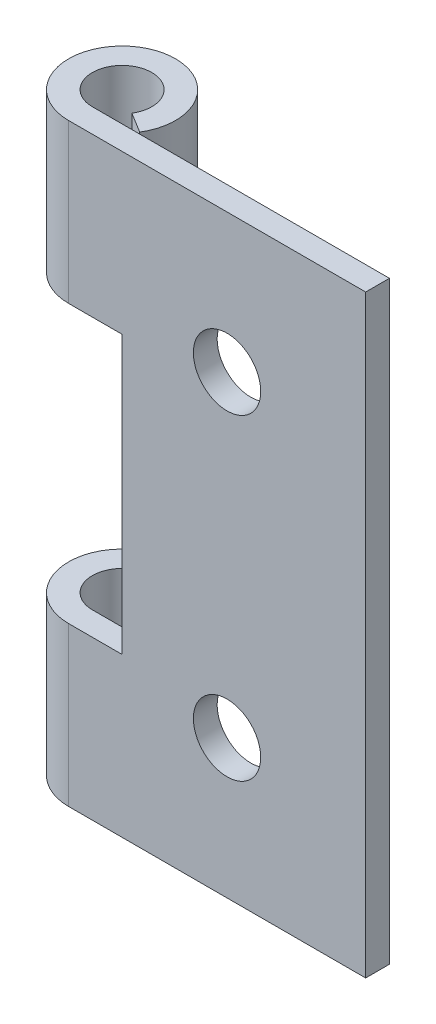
ISO-10303-21;
HEADER;
FILE_DESCRIPTION(('STEP AP214'),'2;1');
FILE_NAME('part.step','',(''),(''),'','','');
FILE_SCHEMA(('AUTOMOTIVE_DESIGN { 1 0 10303 214 1 1 1 1 }'));
ENDSEC;
DATA;
#1=APPLICATION_CONTEXT('core data for automotive mechanical design processes');
#2=APPLICATION_PROTOCOL_DEFINITION('international standard','automotive_design',2000,#1);
#3=PRODUCT_CONTEXT('',#1,'mechanical');
#4=PRODUCT('Part','Part','',(#3));
#5=PRODUCT_RELATED_PRODUCT_CATEGORY('part','',(#4));
#6=PRODUCT_DEFINITION_FORMATION('','',#4);
#7=PRODUCT_DEFINITION_CONTEXT('part definition',#1,'design');
#8=PRODUCT_DEFINITION('design','',#6,#7);
#9=PRODUCT_DEFINITION_SHAPE('','',#8);
#10=(LENGTH_UNIT() NAMED_UNIT(*) SI_UNIT(.MILLI.,.METRE.));
#11=(NAMED_UNIT(*) PLANE_ANGLE_UNIT() SI_UNIT($,.RADIAN.));
#12=(NAMED_UNIT(*) SI_UNIT($,.STERADIAN.) SOLID_ANGLE_UNIT());
#13=UNCERTAINTY_MEASURE_WITH_UNIT(LENGTH_MEASURE(1.E-05),#10,'distance_accuracy_value','');
#14=(GEOMETRIC_REPRESENTATION_CONTEXT(3) GLOBAL_UNCERTAINTY_ASSIGNED_CONTEXT((#13)) GLOBAL_UNIT_ASSIGNED_CONTEXT((#10,
#11,#12)) REPRESENTATION_CONTEXT('',''));
#15=CARTESIAN_POINT('',(0.,0.,0.));
#16=DIRECTION('',(0.,0.,1.));
#17=DIRECTION('',(1.,0.,0.));
#18=AXIS2_PLACEMENT_3D('',#15,#16,#17);
#19=CARTESIAN_POINT('',(0.,-30.,0.599999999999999));
#20=DIRECTION('',(0.,0.,1.));
#21=DIRECTION('',(1.,0.,0.));
#22=AXIS2_PLACEMENT_3D('',#19,#20,#21);
#23=PLANE('',#22);
#24=CARTESIAN_POINT('',(8.,-23.,0.599999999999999));
#25=DIRECTION('',(0.,0.,-1.));
#26=DIRECTION('',(-1.,0.,0.));
#27=AXIS2_PLACEMENT_3D('',#24,#25,#26);
#28=CIRCLE('',#27,1.7);
#29=CARTESIAN_POINT('',(6.3,-23.,0.599999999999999));
#30=VERTEX_POINT('',#29);
#31=EDGE_CURVE('E207',#30,#30,#28,.T.);
#32=ORIENTED_EDGE('',*,*,#31,.T.);
#33=EDGE_LOOP('',(#32));
#34=FACE_BOUND('',#33,.T.);
#35=CARTESIAN_POINT('',(8.,-7.,0.599999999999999));
#36=DIRECTION('',(0.,0.,-1.));
#37=DIRECTION('',(-1.,0.,0.));
#38=AXIS2_PLACEMENT_3D('',#35,#36,#37);
#39=CIRCLE('',#38,1.7);
#40=CARTESIAN_POINT('',(6.3,-7.,0.599999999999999));
#41=VERTEX_POINT('',#40);
#42=EDGE_CURVE('E249',#41,#41,#39,.T.);
#43=ORIENTED_EDGE('',*,*,#42,.T.);
#44=EDGE_LOOP('',(#43));
#45=FACE_BOUND('',#44,.T.);
#46=DIRECTION('',(0.,1.,0.));
#47=VECTOR('',#46,1.);
#48=CARTESIAN_POINT('',(0.,-30.,0.599999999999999));
#49=LINE('',#48,#47);
#50=CARTESIAN_POINT('',(0.,-8.,0.599999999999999));
#51=VERTEX_POINT('',#50);
#52=CARTESIAN_POINT('',(0.,0.,0.599999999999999));
#53=VERTEX_POINT('',#52);
#54=EDGE_CURVE('E121',#51,#53,#49,.T.);
#55=ORIENTED_EDGE('',*,*,#54,.F.);
#56=DIRECTION('',(-1.,0.,0.));
#57=VECTOR('',#56,1.);
#58=CARTESIAN_POINT('',(0.,-8.,0.599999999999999));
#59=LINE('',#58,#57);
#60=CARTESIAN_POINT('',(2.7,-8.,0.599999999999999));
#61=VERTEX_POINT('',#60);
#62=EDGE_CURVE('E183',#61,#51,#59,.T.);
#63=ORIENTED_EDGE('',*,*,#62,.F.);
#64=DIRECTION('',(0.,-1.,0.));
#65=VECTOR('',#64,1.);
#66=CARTESIAN_POINT('',(2.7,-8.,0.599999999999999));
#67=LINE('',#66,#65);
#68=CARTESIAN_POINT('',(2.7,-22.,0.599999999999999));
#69=VERTEX_POINT('',#68);
#70=EDGE_CURVE('E146',#61,#69,#67,.T.);
#71=ORIENTED_EDGE('',*,*,#70,.T.);
#72=DIRECTION('',(-1.,0.,0.));
#73=VECTOR('',#72,1.);
#74=CARTESIAN_POINT('',(0.,-22.,0.599999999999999));
#75=LINE('',#74,#73);
#76=CARTESIAN_POINT('',(0.,-22.,0.599999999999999));
#77=VERTEX_POINT('',#76);
#78=EDGE_CURVE('E210',#69,#77,#75,.T.);
#79=ORIENTED_EDGE('',*,*,#78,.T.);
#80=CARTESIAN_POINT('',(0.,-30.,0.599999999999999));
#81=VERTEX_POINT('',#80);
#82=EDGE_CURVE('E47',#81,#77,#49,.T.);
#83=ORIENTED_EDGE('',*,*,#82,.F.);
#84=DIRECTION('',(1.,0.,0.));
#85=VECTOR('',#84,1.);
#86=CARTESIAN_POINT('',(0.,-30.,0.599999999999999));
#87=LINE('',#86,#85);
#88=CARTESIAN_POINT('',(15.,-30.,0.599999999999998));
#89=VERTEX_POINT('',#88);
#90=EDGE_CURVE('E130',#81,#89,#87,.T.);
#91=ORIENTED_EDGE('',*,*,#90,.T.);
#92=DIRECTION('',(0.,1.,0.));
#93=VECTOR('',#92,1.);
#94=CARTESIAN_POINT('',(15.,-30.,0.599999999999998));
#95=LINE('',#94,#93);
#96=CARTESIAN_POINT('',(15.,0.,0.599999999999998));
#97=VERTEX_POINT('',#96);
#98=EDGE_CURVE('E11',#89,#97,#95,.T.);
#99=ORIENTED_EDGE('',*,*,#98,.T.);
#100=DIRECTION('',(1.,0.,0.));
#101=VECTOR('',#100,1.);
#102=CARTESIAN_POINT('',(0.,0.,0.599999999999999));
#103=LINE('',#102,#101);
#104=EDGE_CURVE('E158',#53,#97,#103,.T.);
#105=ORIENTED_EDGE('',*,*,#104,.F.);
#106=EDGE_LOOP('',(#55,#63,#71,#79,#83,#91,#99,#105));
#107=FACE_BOUND('',#106,.T.);
#108=ADVANCED_FACE('F38',(#34,#45,#107),#23,.T.);
#109=CARTESIAN_POINT('',(0.,-30.,-2.1));
#110=DIRECTION('',(0.,1.,0.));
#111=DIRECTION('',(0.,0.,1.));
#112=AXIS2_PLACEMENT_3D('',#109,#110,#111);
#113=CYLINDRICAL_SURFACE('',#112,2.7);
#114=DIRECTION('',(0.,1.,0.));
#115=VECTOR('',#114,1.);
#116=CARTESIAN_POINT('',(2.30184189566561,-30.,-0.688786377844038));
#117=LINE('',#116,#115);
#118=CARTESIAN_POINT('',(2.30184189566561,-8.,-0.688786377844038));
#119=VERTEX_POINT('',#118);
#120=CARTESIAN_POINT('',(2.30184189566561,0.,-0.688786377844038));
#121=VERTEX_POINT('',#120);
#122=EDGE_CURVE('E122',#119,#121,#117,.T.);
#123=ORIENTED_EDGE('',*,*,#122,.F.);
#124=CARTESIAN_POINT('',(0.,-8.,-2.1));
#125=DIRECTION('',(0.,-1.,0.));
#126=DIRECTION('',(0.,0.,-1.));
#127=AXIS2_PLACEMENT_3D('',#124,#125,#126);
#128=CIRCLE('',#127,2.7);
#129=EDGE_CURVE('E191',#51,#119,#128,.T.);
#130=ORIENTED_EDGE('',*,*,#129,.F.);
#131=ORIENTED_EDGE('',*,*,#54,.T.);
#132=CARTESIAN_POINT('',(0.,0.,-2.1));
#133=DIRECTION('',(0.,1.,0.));
#134=DIRECTION('',(0.,0.,1.));
#135=AXIS2_PLACEMENT_3D('',#132,#133,#134);
#136=CIRCLE('',#135,2.7);
#137=EDGE_CURVE('E155',#121,#53,#136,.T.);
#138=ORIENTED_EDGE('',*,*,#137,.F.);
#139=EDGE_LOOP('',(#123,#130,#131,#138));
#140=FACE_BOUND('',#139,.T.);
#141=ADVANCED_FACE('F189',(#140),#113,.T.);
#142=CARTESIAN_POINT('',(2.30184189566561,-30.,-0.688786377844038));
#143=DIRECTION('',(-0.522671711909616,0.,0.852534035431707));
#144=DIRECTION('',(0.852534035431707,0.,0.522671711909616));
#145=AXIS2_PLACEMENT_3D('',#142,#143,#144);
#146=PLANE('',#145);
#147=DIRECTION('',(0.,1.,0.));
#148=VECTOR('',#147,1.);
#149=CARTESIAN_POINT('',(1.27880105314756,-30.,-1.31599243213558));
#150=LINE('',#149,#148);
#151=CARTESIAN_POINT('',(1.27880105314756,-8.,-1.31599243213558));
#152=VERTEX_POINT('',#151);
#153=CARTESIAN_POINT('',(1.27880105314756,0.,-1.31599243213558));
#154=VERTEX_POINT('',#153);
#155=EDGE_CURVE('E163',#152,#154,#150,.T.);
#156=ORIENTED_EDGE('',*,*,#155,.F.);
#157=DIRECTION('',(-0.852534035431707,0.,-0.522671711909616));
#158=VECTOR('',#157,1.);
#159=CARTESIAN_POINT('',(1.27880105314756,-8.,-1.31599243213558));
#160=LINE('',#159,#158);
#161=EDGE_CURVE('E195',#119,#152,#160,.T.);
#162=ORIENTED_EDGE('',*,*,#161,.F.);
#163=ORIENTED_EDGE('',*,*,#122,.T.);
#164=DIRECTION('',(0.852534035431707,0.,0.522671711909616));
#165=VECTOR('',#164,1.);
#166=CARTESIAN_POINT('',(2.30184189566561,0.,-0.688786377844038));
#167=LINE('',#166,#165);
#168=EDGE_CURVE('E152',#154,#121,#167,.T.);
#169=ORIENTED_EDGE('',*,*,#168,.F.);
#170=EDGE_LOOP('',(#156,#162,#163,#169));
#171=FACE_BOUND('',#170,.T.);
#172=ADVANCED_FACE('F289',(#171),#146,.T.);
#173=CARTESIAN_POINT('',(0.,-30.,-2.1));
#174=DIRECTION('',(0.,1.,0.));
#175=DIRECTION('',(0.,0.,1.));
#176=AXIS2_PLACEMENT_3D('',#173,#174,#175);
#177=CYLINDRICAL_SURFACE('',#176,1.5);
#178=DIRECTION('',(0.,1.,0.));
#179=VECTOR('',#178,1.);
#180=CARTESIAN_POINT('',(0.,-30.,-0.600000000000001));
#181=LINE('',#180,#179);
#182=CARTESIAN_POINT('',(0.,-8.,-0.600000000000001));
#183=VERTEX_POINT('',#182);
#184=CARTESIAN_POINT('',(0.,0.,-0.600000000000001));
#185=VERTEX_POINT('',#184);
#186=EDGE_CURVE('E166',#183,#185,#181,.T.);
#187=ORIENTED_EDGE('',*,*,#186,.F.);
#188=CARTESIAN_POINT('',(0.,-8.,-2.1));
#189=DIRECTION('',(0.,1.,0.));
#190=DIRECTION('',(0.,0.,-1.));
#191=AXIS2_PLACEMENT_3D('',#188,#189,#190);
#192=CIRCLE('',#191,1.5);
#193=EDGE_CURVE('E216',#152,#183,#192,.T.);
#194=ORIENTED_EDGE('',*,*,#193,.F.);
#195=ORIENTED_EDGE('',*,*,#155,.T.);
#196=CARTESIAN_POINT('',(0.,0.,-2.1));
#197=DIRECTION('',(0.,-1.,0.));
#198=DIRECTION('',(0.,0.,1.));
#199=AXIS2_PLACEMENT_3D('',#196,#197,#198);
#200=CIRCLE('',#199,1.5);
#201=EDGE_CURVE('E149',#185,#154,#200,.T.);
#202=ORIENTED_EDGE('',*,*,#201,.F.);
#203=EDGE_LOOP('',(#187,#194,#195,#202));
#204=FACE_BOUND('',#203,.T.);
#205=ADVANCED_FACE('F272',(#204),#177,.F.);
#206=CARTESIAN_POINT('',(0.,-30.,-0.600000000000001));
#207=DIRECTION('',(0.,0.,-1.));
#208=DIRECTION('',(-1.,0.,0.));
#209=AXIS2_PLACEMENT_3D('',#206,#207,#208);
#210=PLANE('',#209);
#211=CARTESIAN_POINT('',(8.,-23.,-0.600000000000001));
#212=DIRECTION('',(0.,0.,-1.));
#213=DIRECTION('',(-1.,0.,0.));
#214=AXIS2_PLACEMENT_3D('',#211,#212,#213);
#215=CIRCLE('',#214,1.7);
#216=CARTESIAN_POINT('',(6.3,-23.,-0.600000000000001));
#217=VERTEX_POINT('',#216);
#218=EDGE_CURVE('E255',#217,#217,#215,.T.);
#219=ORIENTED_EDGE('',*,*,#218,.F.);
#220=EDGE_LOOP('',(#219));
#221=FACE_BOUND('',#220,.T.);
#222=CARTESIAN_POINT('',(8.,-7.,-0.600000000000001));
#223=DIRECTION('',(0.,0.,-1.));
#224=DIRECTION('',(-1.,0.,0.));
#225=AXIS2_PLACEMENT_3D('',#222,#223,#224);
#226=CIRCLE('',#225,1.7);
#227=CARTESIAN_POINT('',(6.3,-7.,-0.600000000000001));
#228=VERTEX_POINT('',#227);
#229=EDGE_CURVE('E252',#228,#228,#226,.T.);
#230=ORIENTED_EDGE('',*,*,#229,.F.);
#231=EDGE_LOOP('',(#230));
#232=FACE_BOUND('',#231,.T.);
#233=DIRECTION('',(0.,-1.,0.));
#234=VECTOR('',#233,1.);
#235=CARTESIAN_POINT('',(2.7,-8.,-0.600000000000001));
#236=LINE('',#235,#234);
#237=CARTESIAN_POINT('',(2.7,-8.,-0.600000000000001));
#238=VERTEX_POINT('',#237);
#239=CARTESIAN_POINT('',(2.7,-22.,-0.600000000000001));
#240=VERTEX_POINT('',#239);
#241=EDGE_CURVE('E197',#238,#240,#236,.T.);
#242=ORIENTED_EDGE('',*,*,#241,.F.);
#243=DIRECTION('',(1.,0.,0.));
#244=VECTOR('',#243,1.);
#245=CARTESIAN_POINT('',(0.,-8.,-0.600000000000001));
#246=LINE('',#245,#244);
#247=EDGE_CURVE('E243',#183,#238,#246,.T.);
#248=ORIENTED_EDGE('',*,*,#247,.F.);
#249=ORIENTED_EDGE('',*,*,#186,.T.);
#250=DIRECTION('',(-1.,0.,0.));
#251=VECTOR('',#250,1.);
#252=CARTESIAN_POINT('',(0.,0.,-0.600000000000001));
#253=LINE('',#252,#251);
#254=CARTESIAN_POINT('',(15.,0.,-0.600000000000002));
#255=VERTEX_POINT('',#254);
#256=EDGE_CURVE('E145',#255,#185,#253,.T.);
#257=ORIENTED_EDGE('',*,*,#256,.F.);
#258=DIRECTION('',(0.,1.,0.));
#259=VECTOR('',#258,1.);
#260=CARTESIAN_POINT('',(15.,-30.,-0.600000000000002));
#261=LINE('',#260,#259);
#262=CARTESIAN_POINT('',(15.,-30.,-0.600000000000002));
#263=VERTEX_POINT('',#262);
#264=EDGE_CURVE('E42',#263,#255,#261,.T.);
#265=ORIENTED_EDGE('',*,*,#264,.F.);
#266=DIRECTION('',(-1.,0.,0.));
#267=VECTOR('',#266,1.);
#268=CARTESIAN_POINT('',(0.,-30.,-0.600000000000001));
#269=LINE('',#268,#267);
#270=CARTESIAN_POINT('',(0.,-30.,-0.600000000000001));
#271=VERTEX_POINT('',#270);
#272=EDGE_CURVE('E137',#263,#271,#269,.T.);
#273=ORIENTED_EDGE('',*,*,#272,.T.);
#274=CARTESIAN_POINT('',(0.,-22.,-0.600000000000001));
#275=VERTEX_POINT('',#274);
#276=EDGE_CURVE('E164',#271,#275,#181,.T.);
#277=ORIENTED_EDGE('',*,*,#276,.T.);
#278=DIRECTION('',(1.,0.,0.));
#279=VECTOR('',#278,1.);
#280=CARTESIAN_POINT('',(0.,-22.,-0.600000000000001));
#281=LINE('',#280,#279);
#282=EDGE_CURVE('E206',#275,#240,#281,.T.);
#283=ORIENTED_EDGE('',*,*,#282,.T.);
#284=EDGE_LOOP('',(#242,#248,#249,#257,#265,#273,#277,#283));
#285=FACE_BOUND('',#284,.T.);
#286=ADVANCED_FACE('F173',(#221,#232,#285),#210,.T.);
#287=CARTESIAN_POINT('',(15.,-30.,-0.600000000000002));
#288=DIRECTION('',(1.,0.,0.));
#289=DIRECTION('',(0.,0.,-1.));
#290=AXIS2_PLACEMENT_3D('',#287,#288,#289);
#291=PLANE('',#290);
#292=DIRECTION('',(0.,0.,-1.));
#293=VECTOR('',#292,1.);
#294=CARTESIAN_POINT('',(15.,0.,-0.600000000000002));
#295=LINE('',#294,#293);
#296=EDGE_CURVE('E142',#97,#255,#295,.T.);
#297=ORIENTED_EDGE('',*,*,#296,.F.);
#298=ORIENTED_EDGE('',*,*,#98,.F.);
#299=DIRECTION('',(0.,0.,-1.));
#300=VECTOR('',#299,1.);
#301=CARTESIAN_POINT('',(15.,-30.,-0.600000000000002));
#302=LINE('',#301,#300);
#303=EDGE_CURVE('E160',#89,#263,#302,.T.);
#304=ORIENTED_EDGE('',*,*,#303,.T.);
#305=ORIENTED_EDGE('',*,*,#264,.T.);
#306=EDGE_LOOP('',(#297,#298,#304,#305));
#307=FACE_BOUND('',#306,.T.);
#308=ADVANCED_FACE('F40',(#307),#291,.T.);
#309=CARTESIAN_POINT('',(0.,-22.,-2.1));
#310=DIRECTION('',(0.,-1.,0.));
#311=DIRECTION('',(0.,0.,-1.));
#312=AXIS2_PLACEMENT_3D('',#309,#310,#311);
#313=CIRCLE('',#312,2.7);
#314=CARTESIAN_POINT('',(2.30184189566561,-22.,-0.688786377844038));
#315=VERTEX_POINT('',#314);
#316=EDGE_CURVE('E117',#77,#315,#313,.T.);
#317=ORIENTED_EDGE('',*,*,#316,.T.);
#318=CARTESIAN_POINT('',(2.30184189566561,-30.,-0.688786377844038));
#319=VERTEX_POINT('',#318);
#320=EDGE_CURVE('E109',#319,#315,#117,.T.);
#321=ORIENTED_EDGE('',*,*,#320,.F.);
#322=CARTESIAN_POINT('',(0.,-30.,-2.1));
#323=DIRECTION('',(0.,1.,0.));
#324=DIRECTION('',(0.,0.,1.));
#325=AXIS2_PLACEMENT_3D('',#322,#323,#324);
#326=CIRCLE('',#325,2.7);
#327=EDGE_CURVE('E113',#319,#81,#326,.T.);
#328=ORIENTED_EDGE('',*,*,#327,.T.);
#329=ORIENTED_EDGE('',*,*,#82,.T.);
#330=EDGE_LOOP('',(#317,#321,#328,#329));
#331=FACE_BOUND('',#330,.T.);
#332=ADVANCED_FACE('F111',(#331),#113,.T.);
#333=DIRECTION('',(-0.852534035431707,0.,-0.522671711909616));
#334=VECTOR('',#333,1.);
#335=CARTESIAN_POINT('',(1.27880105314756,-22.,-1.31599243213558));
#336=LINE('',#335,#334);
#337=CARTESIAN_POINT('',(1.27880105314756,-22.,-1.31599243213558));
#338=VERTEX_POINT('',#337);
#339=EDGE_CURVE('E214',#315,#338,#336,.T.);
#340=ORIENTED_EDGE('',*,*,#339,.T.);
#341=CARTESIAN_POINT('',(1.27880105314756,-30.,-1.31599243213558));
#342=VERTEX_POINT('',#341);
#343=EDGE_CURVE('E134',#342,#338,#150,.T.);
#344=ORIENTED_EDGE('',*,*,#343,.F.);
#345=DIRECTION('',(0.852534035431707,0.,0.522671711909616));
#346=VECTOR('',#345,1.);
#347=CARTESIAN_POINT('',(2.30184189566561,-30.,-0.688786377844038));
#348=LINE('',#347,#346);
#349=EDGE_CURVE('E128',#342,#319,#348,.T.);
#350=ORIENTED_EDGE('',*,*,#349,.T.);
#351=ORIENTED_EDGE('',*,*,#320,.T.);
#352=EDGE_LOOP('',(#340,#344,#350,#351));
#353=FACE_BOUND('',#352,.T.);
#354=ADVANCED_FACE('F132',(#353),#146,.T.);
#355=CARTESIAN_POINT('',(0.,-22.,-2.1));
#356=DIRECTION('',(0.,1.,0.));
#357=DIRECTION('',(0.,0.,-1.));
#358=AXIS2_PLACEMENT_3D('',#355,#356,#357);
#359=CIRCLE('',#358,1.5);
#360=EDGE_CURVE('E203',#338,#275,#359,.T.);
#361=ORIENTED_EDGE('',*,*,#360,.T.);
#362=ORIENTED_EDGE('',*,*,#276,.F.);
#363=CARTESIAN_POINT('',(0.,-30.,-2.1));
#364=DIRECTION('',(0.,-1.,0.));
#365=DIRECTION('',(0.,0.,1.));
#366=AXIS2_PLACEMENT_3D('',#363,#364,#365);
#367=CIRCLE('',#366,1.5);
#368=EDGE_CURVE('E135',#271,#342,#367,.T.);
#369=ORIENTED_EDGE('',*,*,#368,.T.);
#370=ORIENTED_EDGE('',*,*,#343,.T.);
#371=EDGE_LOOP('',(#361,#362,#369,#370));
#372=FACE_BOUND('',#371,.T.);
#373=ADVANCED_FACE('F220',(#372),#177,.F.);
#374=CARTESIAN_POINT('',(0.,-30.,-2.1));
#375=DIRECTION('',(0.,1.,0.));
#376=DIRECTION('',(0.,0.,1.));
#377=AXIS2_PLACEMENT_3D('',#374,#375,#376);
#378=PLANE('',#377);
#379=ORIENTED_EDGE('',*,*,#303,.F.);
#380=ORIENTED_EDGE('',*,*,#90,.F.);
#381=ORIENTED_EDGE('',*,*,#327,.F.);
#382=ORIENTED_EDGE('',*,*,#349,.F.);
#383=ORIENTED_EDGE('',*,*,#368,.F.);
#384=ORIENTED_EDGE('',*,*,#272,.F.);
#385=EDGE_LOOP('',(#379,#380,#381,#382,#383,#384));
#386=FACE_BOUND('',#385,.T.);
#387=ADVANCED_FACE('F126',(#386),#378,.F.);
#388=CARTESIAN_POINT('',(0.,0.,-2.1));
#389=DIRECTION('',(0.,1.,0.));
#390=DIRECTION('',(0.,0.,1.));
#391=AXIS2_PLACEMENT_3D('',#388,#389,#390);
#392=PLANE('',#391);
#393=ORIENTED_EDGE('',*,*,#296,.T.);
#394=ORIENTED_EDGE('',*,*,#256,.T.);
#395=ORIENTED_EDGE('',*,*,#201,.T.);
#396=ORIENTED_EDGE('',*,*,#168,.T.);
#397=ORIENTED_EDGE('',*,*,#137,.T.);
#398=ORIENTED_EDGE('',*,*,#104,.T.);
#399=EDGE_LOOP('',(#393,#394,#395,#396,#397,#398));
#400=FACE_BOUND('',#399,.T.);
#401=ADVANCED_FACE('F175',(#400),#392,.T.);
#402=CARTESIAN_POINT('',(2.7,-8.,-0.600000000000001));
#403=DIRECTION('',(1.,0.,0.));
#404=DIRECTION('',(0.,0.,-1.));
#405=AXIS2_PLACEMENT_3D('',#402,#403,#404);
#406=PLANE('',#405);
#407=DIRECTION('',(0.,0.,1.));
#408=VECTOR('',#407,1.);
#409=CARTESIAN_POINT('',(2.7,-22.,-0.600000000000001));
#410=LINE('',#409,#408);
#411=EDGE_CURVE('E55',#240,#69,#410,.T.);
#412=ORIENTED_EDGE('',*,*,#411,.T.);
#413=ORIENTED_EDGE('',*,*,#70,.F.);
#414=DIRECTION('',(0.,0.,1.));
#415=VECTOR('',#414,1.);
#416=CARTESIAN_POINT('',(2.7,-8.,-0.600000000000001));
#417=LINE('',#416,#415);
#418=EDGE_CURVE('E199',#238,#61,#417,.T.);
#419=ORIENTED_EDGE('',*,*,#418,.F.);
#420=ORIENTED_EDGE('',*,*,#241,.T.);
#421=EDGE_LOOP('',(#412,#413,#419,#420));
#422=FACE_BOUND('',#421,.T.);
#423=ADVANCED_FACE('F242',(#422),#406,.F.);
#424=CARTESIAN_POINT('',(0.,-8.,-2.1));
#425=DIRECTION('',(0.,-1.,0.));
#426=DIRECTION('',(0.,0.,-1.));
#427=AXIS2_PLACEMENT_3D('',#424,#425,#426);
#428=PLANE('',#427);
#429=ORIENTED_EDGE('',*,*,#193,.T.);
#430=ORIENTED_EDGE('',*,*,#247,.T.);
#431=ORIENTED_EDGE('',*,*,#418,.T.);
#432=ORIENTED_EDGE('',*,*,#62,.T.);
#433=ORIENTED_EDGE('',*,*,#129,.T.);
#434=ORIENTED_EDGE('',*,*,#161,.T.);
#435=EDGE_LOOP('',(#429,#430,#431,#432,#433,#434));
#436=FACE_BOUND('',#435,.T.);
#437=ADVANCED_FACE('F244',(#436),#428,.T.);
#438=CARTESIAN_POINT('',(0.,-22.,-2.1));
#439=DIRECTION('',(0.,-1.,0.));
#440=DIRECTION('',(0.,0.,-1.));
#441=AXIS2_PLACEMENT_3D('',#438,#439,#440);
#442=PLANE('',#441);
#443=ORIENTED_EDGE('',*,*,#360,.F.);
#444=ORIENTED_EDGE('',*,*,#339,.F.);
#445=ORIENTED_EDGE('',*,*,#316,.F.);
#446=ORIENTED_EDGE('',*,*,#78,.F.);
#447=ORIENTED_EDGE('',*,*,#411,.F.);
#448=ORIENTED_EDGE('',*,*,#282,.F.);
#449=EDGE_LOOP('',(#443,#444,#445,#446,#447,#448));
#450=FACE_BOUND('',#449,.T.);
#451=ADVANCED_FACE('F225',(#450),#442,.F.);
#452=CARTESIAN_POINT('',(8.,-7.,0.599999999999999));
#453=DIRECTION('',(0.,0.,-1.));
#454=DIRECTION('',(-1.,0.,0.));
#455=AXIS2_PLACEMENT_3D('',#452,#453,#454);
#456=CYLINDRICAL_SURFACE('',#455,1.7);
#457=ORIENTED_EDGE('',*,*,#42,.F.);
#458=EDGE_LOOP('',(#457));
#459=FACE_BOUND('',#458,.T.);
#460=ORIENTED_EDGE('',*,*,#229,.T.);
#461=EDGE_LOOP('',(#460));
#462=FACE_BOUND('',#461,.T.);
#463=ADVANCED_FACE('F266',(#459,#462),#456,.F.);
#464=CARTESIAN_POINT('',(8.,-23.,0.599999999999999));
#465=DIRECTION('',(0.,0.,-1.));
#466=DIRECTION('',(-1.,0.,0.));
#467=AXIS2_PLACEMENT_3D('',#464,#465,#466);
#468=CYLINDRICAL_SURFACE('',#467,1.7);
#469=ORIENTED_EDGE('',*,*,#31,.F.);
#470=EDGE_LOOP('',(#469));
#471=FACE_BOUND('',#470,.T.);
#472=ORIENTED_EDGE('',*,*,#218,.T.);
#473=EDGE_LOOP('',(#472));
#474=FACE_BOUND('',#473,.T.);
#475=ADVANCED_FACE('F263',(#471,#474),#468,.F.);
#476=CLOSED_SHELL('',(#108,#141,#172,#205,#286,#308,#332,#354,#373,#387,#401,#423,#437,#451,
#463,#475));
#477=MANIFOLD_SOLID_BREP('B2',#476);
#478=ADVANCED_BREP_SHAPE_REPRESENTATION('',(#18,#477),#14);
#479=SHAPE_DEFINITION_REPRESENTATION(#9,#478);
ENDSEC;
END-ISO-10303-21;
